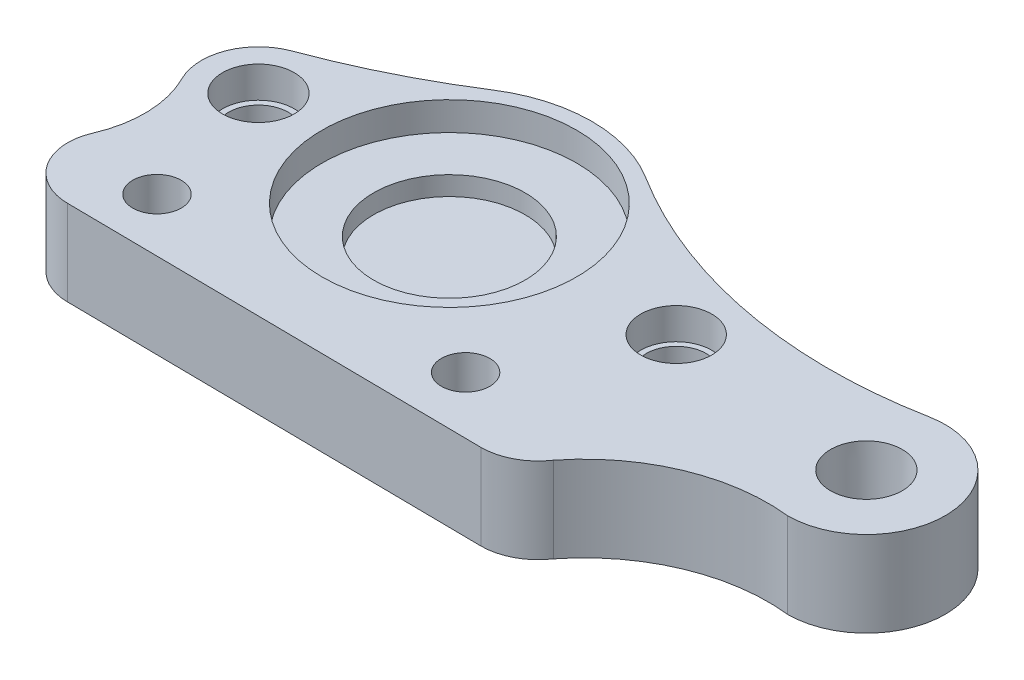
ISO-10303-21;
HEADER;
FILE_DESCRIPTION(('STEP AP214'),'2;1');
FILE_NAME('part.step','',(''),(''),'','','');
FILE_SCHEMA(('AUTOMOTIVE_DESIGN { 1 0 10303 214 1 1 1 1 }'));
ENDSEC;
DATA;
#1=APPLICATION_CONTEXT('core data for automotive mechanical design processes');
#2=APPLICATION_PROTOCOL_DEFINITION('international standard','automotive_design',2000,#1);
#3=PRODUCT_CONTEXT('',#1,'mechanical');
#4=PRODUCT('Part','Part','',(#3));
#5=PRODUCT_RELATED_PRODUCT_CATEGORY('part','',(#4));
#6=PRODUCT_DEFINITION_FORMATION('','',#4);
#7=PRODUCT_DEFINITION_CONTEXT('part definition',#1,'design');
#8=PRODUCT_DEFINITION('design','',#6,#7);
#9=PRODUCT_DEFINITION_SHAPE('','',#8);
#10=(LENGTH_UNIT() NAMED_UNIT(*) SI_UNIT(.MILLI.,.METRE.));
#11=(NAMED_UNIT(*) PLANE_ANGLE_UNIT() SI_UNIT($,.RADIAN.));
#12=(NAMED_UNIT(*) SI_UNIT($,.STERADIAN.) SOLID_ANGLE_UNIT());
#13=UNCERTAINTY_MEASURE_WITH_UNIT(LENGTH_MEASURE(1.E-05),#10,'distance_accuracy_value','');
#14=(GEOMETRIC_REPRESENTATION_CONTEXT(3) GLOBAL_UNCERTAINTY_ASSIGNED_CONTEXT((#13)) GLOBAL_UNIT_ASSIGNED_CONTEXT((#10,
#11,#12)) REPRESENTATION_CONTEXT('',''));
#15=CARTESIAN_POINT('',(0.,0.,0.));
#16=DIRECTION('',(0.,0.,1.));
#17=DIRECTION('',(1.,0.,0.));
#18=AXIS2_PLACEMENT_3D('',#15,#16,#17);
#19=CARTESIAN_POINT('',(-40.22,18.,0.));
#20=DIRECTION('',(0.,-1.,0.));
#21=DIRECTION('',(0.,0.,-1.));
#22=AXIS2_PLACEMENT_3D('',#19,#20,#21);
#23=CYLINDRICAL_SURFACE('',#22,12.);
#24=CARTESIAN_POINT('',(-40.22,0.,0.));
#25=DIRECTION('',(0.,1.,0.));
#26=DIRECTION('',(0.,0.,1.));
#27=AXIS2_PLACEMENT_3D('',#24,#25,#26);
#28=CIRCLE('',#27,12.);
#29=CARTESIAN_POINT('',(-44.3920821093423,0.,-11.2513879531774));
#30=VERTEX_POINT('',#29);
#31=CARTESIAN_POINT('',(-50.9462208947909,0.,5.38035178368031));
#32=VERTEX_POINT('',#31);
#33=EDGE_CURVE('E233',#30,#32,#28,.T.);
#34=ORIENTED_EDGE('',*,*,#33,.T.);
#35=DIRECTION('',(0.,-1.,0.));
#36=VECTOR('',#35,1.);
#37=CARTESIAN_POINT('',(-50.9462208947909,18.,5.38035178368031));
#38=LINE('',#37,#36);
#39=CARTESIAN_POINT('',(-50.9462208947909,18.,5.38035178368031));
#40=VERTEX_POINT('',#39);
#41=EDGE_CURVE('E185',#40,#32,#38,.T.);
#42=ORIENTED_EDGE('',*,*,#41,.F.);
#43=CARTESIAN_POINT('',(-40.22,18.,0.));
#44=DIRECTION('',(0.,1.,0.));
#45=DIRECTION('',(0.,0.,1.));
#46=AXIS2_PLACEMENT_3D('',#43,#44,#45);
#47=CIRCLE('',#46,12.);
#48=CARTESIAN_POINT('',(-44.3920821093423,18.,-11.2513879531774));
#49=VERTEX_POINT('',#48);
#50=EDGE_CURVE('E281',#49,#40,#47,.T.);
#51=ORIENTED_EDGE('',*,*,#50,.F.);
#52=DIRECTION('',(0.,-1.,0.));
#53=VECTOR('',#52,1.);
#54=CARTESIAN_POINT('',(-44.3920821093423,18.,-11.2513879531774));
#55=LINE('',#54,#53);
#56=EDGE_CURVE('E192',#49,#30,#55,.T.);
#57=ORIENTED_EDGE('',*,*,#56,.T.);
#58=EDGE_LOOP('',(#34,#42,#51,#57));
#59=FACE_BOUND('',#58,.T.);
#60=ADVANCED_FACE('F73',(#59),#23,.T.);
#61=CARTESIAN_POINT('',(-71.3762101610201,18.,15.628185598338));
#62=DIRECTION('',(0.,-1.,0.));
#63=DIRECTION('',(0.,0.,-1.));
#64=AXIS2_PLACEMENT_3D('',#61,#62,#63);
#65=CYLINDRICAL_SURFACE('',#64,22.8561273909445);
#66=CARTESIAN_POINT('',(-71.3762101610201,0.,15.628185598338));
#67=DIRECTION('',(0.,1.,0.));
#68=DIRECTION('',(0.,0.,1.));
#69=AXIS2_PLACEMENT_3D('',#66,#67,#68);
#70=CIRCLE('',#69,22.8561273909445);
#71=CARTESIAN_POINT('',(-50.3923689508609,0.,24.688040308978));
#72=VERTEX_POINT('',#71);
#73=EDGE_CURVE('E237',#32,#72,#70,.F.);
#74=ORIENTED_EDGE('',*,*,#73,.T.);
#75=DIRECTION('',(0.,-1.,0.));
#76=VECTOR('',#75,1.);
#77=CARTESIAN_POINT('',(-50.3923689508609,18.,24.688040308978));
#78=LINE('',#77,#76);
#79=CARTESIAN_POINT('',(-50.3923689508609,18.,24.688040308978));
#80=VERTEX_POINT('',#79);
#81=EDGE_CURVE('E181',#80,#72,#78,.T.);
#82=ORIENTED_EDGE('',*,*,#81,.F.);
#83=CARTESIAN_POINT('',(-71.3762101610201,18.,15.628185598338));
#84=DIRECTION('',(0.,1.,0.));
#85=DIRECTION('',(0.,0.,1.));
#86=AXIS2_PLACEMENT_3D('',#83,#84,#85);
#87=CIRCLE('',#86,22.8561273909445);
#88=EDGE_CURVE('E172',#40,#80,#87,.F.);
#89=ORIENTED_EDGE('',*,*,#88,.F.);
#90=ORIENTED_EDGE('',*,*,#41,.T.);
#91=EDGE_LOOP('',(#74,#82,#89,#90));
#92=FACE_BOUND('',#91,.T.);
#93=ADVANCED_FACE('F290',(#92),#65,.F.);
#94=CARTESIAN_POINT('',(-40.22,18.,29.08));
#95=DIRECTION('',(0.,-1.,0.));
#96=DIRECTION('',(0.,0.,-1.));
#97=AXIS2_PLACEMENT_3D('',#94,#95,#96);
#98=CYLINDRICAL_SURFACE('',#97,11.08);
#99=CARTESIAN_POINT('',(-40.22,0.,29.08));
#100=DIRECTION('',(0.,1.,0.));
#101=DIRECTION('',(0.,0.,1.));
#102=AXIS2_PLACEMENT_3D('',#99,#100,#101);
#103=CIRCLE('',#102,11.08);
#104=CARTESIAN_POINT('',(-40.22,0.,40.16));
#105=VERTEX_POINT('',#104);
#106=EDGE_CURVE('E179',#72,#105,#103,.T.);
#107=ORIENTED_EDGE('',*,*,#106,.T.);
#108=DIRECTION('',(0.,-1.,0.));
#109=VECTOR('',#108,1.);
#110=CARTESIAN_POINT('',(-40.22,18.,40.16));
#111=LINE('',#110,#109);
#112=CARTESIAN_POINT('',(-40.22,18.,40.16));
#113=VERTEX_POINT('',#112);
#114=EDGE_CURVE('E162',#113,#105,#111,.T.);
#115=ORIENTED_EDGE('',*,*,#114,.F.);
#116=CARTESIAN_POINT('',(-40.22,18.,29.08));
#117=DIRECTION('',(0.,1.,0.));
#118=DIRECTION('',(0.,0.,1.));
#119=AXIS2_PLACEMENT_3D('',#116,#117,#118);
#120=CIRCLE('',#119,11.08);
#121=EDGE_CURVE('E166',#80,#113,#120,.T.);
#122=ORIENTED_EDGE('',*,*,#121,.F.);
#123=ORIENTED_EDGE('',*,*,#81,.T.);
#124=EDGE_LOOP('',(#107,#115,#122,#123));
#125=FACE_BOUND('',#124,.T.);
#126=ADVANCED_FACE('F178',(#125),#98,.T.);
#127=CARTESIAN_POINT('',(-0.456832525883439,18.,40.6073356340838));
#128=DIRECTION('',(0.0112492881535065,0.,-0.999936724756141));
#129=DIRECTION('',(-0.999936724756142,0.,-0.0112492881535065));
#130=AXIS2_PLACEMENT_3D('',#127,#128,#129);
#131=PLANE('',#130);
#132=DIRECTION('',(0.999936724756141,0.,0.0112492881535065));
#133=VECTOR('',#132,1.);
#134=CARTESIAN_POINT('',(-0.456832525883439,0.,40.6073356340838));
#135=LINE('',#134,#133);
#136=CARTESIAN_POINT('',(47.78,0.,41.15));
#137=VERTEX_POINT('',#136);
#138=EDGE_CURVE('E243',#105,#137,#135,.T.);
#139=ORIENTED_EDGE('',*,*,#138,.T.);
#140=DIRECTION('',(0.,-1.,0.));
#141=VECTOR('',#140,1.);
#142=CARTESIAN_POINT('',(47.78,18.,41.15));
#143=LINE('',#142,#141);
#144=CARTESIAN_POINT('',(47.78,18.,41.15));
#145=VERTEX_POINT('',#144);
#146=EDGE_CURVE('E164',#145,#137,#143,.T.);
#147=ORIENTED_EDGE('',*,*,#146,.F.);
#148=DIRECTION('',(0.999936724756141,0.,0.0112492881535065));
#149=VECTOR('',#148,1.);
#150=CARTESIAN_POINT('',(-0.456832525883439,18.,40.6073356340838));
#151=LINE('',#150,#149);
#152=EDGE_CURVE('E157',#113,#145,#151,.T.);
#153=ORIENTED_EDGE('',*,*,#152,.F.);
#154=ORIENTED_EDGE('',*,*,#114,.T.);
#155=EDGE_LOOP('',(#139,#147,#153,#154));
#156=FACE_BOUND('',#155,.T.);
#157=ADVANCED_FACE('F160',(#156),#131,.F.);
#158=CARTESIAN_POINT('',(47.78,18.,29.08));
#159=DIRECTION('',(0.,-1.,0.));
#160=DIRECTION('',(0.,0.,-1.));
#161=AXIS2_PLACEMENT_3D('',#158,#159,#160);
#162=CYLINDRICAL_SURFACE('',#161,12.07);
#163=CARTESIAN_POINT('',(47.78,0.,29.08));
#164=DIRECTION('',(0.,1.,0.));
#165=DIRECTION('',(0.,0.,1.));
#166=AXIS2_PLACEMENT_3D('',#163,#164,#165);
#167=CIRCLE('',#166,12.07);
#168=CARTESIAN_POINT('',(57.7774061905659,0.,35.8428965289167));
#169=VERTEX_POINT('',#168);
#170=EDGE_CURVE('E124',#137,#169,#167,.T.);
#171=ORIENTED_EDGE('',*,*,#170,.T.);
#172=DIRECTION('',(0.,-1.,0.));
#173=VECTOR('',#172,1.);
#174=CARTESIAN_POINT('',(57.7774061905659,18.,35.8428965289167));
#175=LINE('',#174,#173);
#176=CARTESIAN_POINT('',(57.7774061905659,18.,35.8428965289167));
#177=VERTEX_POINT('',#176);
#178=EDGE_CURVE('E131',#177,#169,#175,.T.);
#179=ORIENTED_EDGE('',*,*,#178,.F.);
#180=CARTESIAN_POINT('',(47.78,18.,29.08));
#181=DIRECTION('',(0.,1.,0.));
#182=DIRECTION('',(0.,0.,1.));
#183=AXIS2_PLACEMENT_3D('',#180,#181,#182);
#184=CIRCLE('',#183,12.07);
#185=EDGE_CURVE('E91',#145,#177,#184,.T.);
#186=ORIENTED_EDGE('',*,*,#185,.F.);
#187=ORIENTED_EDGE('',*,*,#146,.T.);
#188=EDGE_LOOP('',(#171,#179,#186,#187));
#189=FACE_BOUND('',#188,.T.);
#190=ADVANCED_FACE('F299',(#189),#162,.T.);
#191=CARTESIAN_POINT('',(88.1701871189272,18.,59.7473100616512));
#192=DIRECTION('',(0.,-1.,0.));
#193=DIRECTION('',(0.,0.,-1.));
#194=AXIS2_PLACEMENT_3D('',#191,#192,#193);
#195=CYLINDRICAL_SURFACE('',#194,38.6670676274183);
#196=CARTESIAN_POINT('',(88.1701871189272,0.,59.7473100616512));
#197=DIRECTION('',(0.,1.,0.));
#198=DIRECTION('',(0.,0.,1.));
#199=AXIS2_PLACEMENT_3D('',#196,#197,#198);
#200=CIRCLE('',#199,38.6670676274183);
#201=CARTESIAN_POINT('',(92.5334852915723,0.,21.3272144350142));
#202=VERTEX_POINT('',#201);
#203=EDGE_CURVE('E216',#202,#169,#200,.T.);
#204=ORIENTED_EDGE('',*,*,#203,.F.);
#205=DIRECTION('',(0.,-1.,0.));
#206=VECTOR('',#205,1.);
#207=CARTESIAN_POINT('',(92.5334852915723,18.,21.3272144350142));
#208=LINE('',#207,#206);
#209=CARTESIAN_POINT('',(92.5334852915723,18.,21.3272144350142));
#210=VERTEX_POINT('',#209);
#211=EDGE_CURVE('E12',#210,#202,#208,.T.);
#212=ORIENTED_EDGE('',*,*,#211,.F.);
#213=CARTESIAN_POINT('',(88.1701871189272,18.,59.7473100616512));
#214=DIRECTION('',(0.,1.,0.));
#215=DIRECTION('',(0.,0.,1.));
#216=AXIS2_PLACEMENT_3D('',#213,#214,#215);
#217=CIRCLE('',#216,38.6670676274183);
#218=EDGE_CURVE('E247',#210,#177,#217,.T.);
#219=ORIENTED_EDGE('',*,*,#218,.T.);
#220=ORIENTED_EDGE('',*,*,#178,.T.);
#221=EDGE_LOOP('',(#204,#212,#219,#220));
#222=FACE_BOUND('',#221,.T.);
#223=ADVANCED_FACE('F75',(#222),#195,.F.);
#224=CARTESIAN_POINT('',(92.5334852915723,18.,4.70378084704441));
#225=DIRECTION('',(0.,-1.,0.));
#226=DIRECTION('',(0.,0.,-1.));
#227=AXIS2_PLACEMENT_3D('',#224,#225,#226);
#228=CYLINDRICAL_SURFACE('',#227,16.6234335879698);
#229=CARTESIAN_POINT('',(92.5334852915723,0.,4.70378084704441));
#230=DIRECTION('',(0.,1.,0.));
#231=DIRECTION('',(0.,0.,1.));
#232=AXIS2_PLACEMENT_3D('',#229,#230,#231);
#233=CIRCLE('',#232,16.6234335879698);
#234=CARTESIAN_POINT('',(89.4042227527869,0.,-11.622463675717));
#235=VERTEX_POINT('',#234);
#236=EDGE_CURVE('E213',#202,#235,#233,.T.);
#237=ORIENTED_EDGE('',*,*,#236,.T.);
#238=DIRECTION('',(0.,-1.,0.));
#239=VECTOR('',#238,1.);
#240=CARTESIAN_POINT('',(89.4042227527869,18.,-11.622463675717));
#241=LINE('',#240,#239);
#242=CARTESIAN_POINT('',(89.4042227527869,18.,-11.622463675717));
#243=VERTEX_POINT('',#242);
#244=EDGE_CURVE('E83',#243,#235,#241,.T.);
#245=ORIENTED_EDGE('',*,*,#244,.F.);
#246=CARTESIAN_POINT('',(92.5334852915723,18.,4.70378084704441));
#247=DIRECTION('',(0.,1.,0.));
#248=DIRECTION('',(0.,0.,1.));
#249=AXIS2_PLACEMENT_3D('',#246,#247,#248);
#250=CIRCLE('',#249,16.6234335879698);
#251=EDGE_CURVE('E269',#210,#243,#250,.T.);
#252=ORIENTED_EDGE('',*,*,#251,.F.);
#253=ORIENTED_EDGE('',*,*,#211,.T.);
#254=EDGE_LOOP('',(#237,#245,#252,#253));
#255=FACE_BOUND('',#254,.T.);
#256=ADVANCED_FACE('F214',(#255),#228,.T.);
#257=CARTESIAN_POINT('',(70.1940017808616,18.,-111.847600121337));
#258=DIRECTION('',(0.,-1.,0.));
#259=DIRECTION('',(0.,0.,-1.));
#260=AXIS2_PLACEMENT_3D('',#257,#258,#259);
#261=CYLINDRICAL_SURFACE('',#260,102.049549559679);
#262=CARTESIAN_POINT('',(70.1940017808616,0.,-111.847600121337));
#263=DIRECTION('',(0.,1.,0.));
#264=DIRECTION('',(0.,0.,1.));
#265=AXIS2_PLACEMENT_3D('',#262,#263,#264);
#266=CIRCLE('',#265,102.049549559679);
#267=CARTESIAN_POINT('',(15.9471960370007,0.,-25.4103706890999));
#268=VERTEX_POINT('',#267);
#269=EDGE_CURVE('E208',#268,#235,#266,.T.);
#270=ORIENTED_EDGE('',*,*,#269,.F.);
#271=DIRECTION('',(0.,-1.,0.));
#272=VECTOR('',#271,1.);
#273=CARTESIAN_POINT('',(15.9471960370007,18.,-25.4103706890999));
#274=LINE('',#273,#272);
#275=CARTESIAN_POINT('',(15.9471960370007,18.,-25.4103706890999));
#276=VERTEX_POINT('',#275);
#277=EDGE_CURVE('E198',#276,#268,#274,.T.);
#278=ORIENTED_EDGE('',*,*,#277,.F.);
#279=CARTESIAN_POINT('',(70.1940017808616,18.,-111.847600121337));
#280=DIRECTION('',(0.,1.,0.));
#281=DIRECTION('',(0.,0.,1.));
#282=AXIS2_PLACEMENT_3D('',#279,#280,#281);
#283=CIRCLE('',#282,102.049549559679);
#284=EDGE_CURVE('E210',#276,#243,#283,.T.);
#285=ORIENTED_EDGE('',*,*,#284,.T.);
#286=ORIENTED_EDGE('',*,*,#244,.T.);
#287=EDGE_LOOP('',(#270,#278,#285,#286));
#288=FACE_BOUND('',#287,.T.);
#289=ADVANCED_FACE('F206',(#288),#261,.F.);
#290=CARTESIAN_POINT('',(0.,18.,0.));
#291=DIRECTION('',(0.,-1.,0.));
#292=DIRECTION('',(0.,0.,-1.));
#293=AXIS2_PLACEMENT_3D('',#290,#291,#292);
#294=CYLINDRICAL_SURFACE('',#293,30.);
#295=CARTESIAN_POINT('',(0.,0.,0.));
#296=DIRECTION('',(0.,1.,0.));
#297=DIRECTION('',(0.,0.,1.));
#298=AXIS2_PLACEMENT_3D('',#295,#296,#297);
#299=CIRCLE('',#298,30.);
#300=CARTESIAN_POINT('',(-16.1209036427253,0.,-25.3005230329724));
#301=VERTEX_POINT('',#300);
#302=EDGE_CURVE('E223',#268,#301,#299,.T.);
#303=ORIENTED_EDGE('',*,*,#302,.T.);
#304=DIRECTION('',(0.,-1.,0.));
#305=VECTOR('',#304,1.);
#306=CARTESIAN_POINT('',(-16.1209036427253,18.,-25.3005230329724));
#307=LINE('',#306,#305);
#308=CARTESIAN_POINT('',(-16.1209036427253,18.,-25.3005230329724));
#309=VERTEX_POINT('',#308);
#310=EDGE_CURVE('E195',#309,#301,#307,.T.);
#311=ORIENTED_EDGE('',*,*,#310,.F.);
#312=CARTESIAN_POINT('',(0.,18.,0.));
#313=DIRECTION('',(0.,1.,0.));
#314=DIRECTION('',(0.,0.,1.));
#315=AXIS2_PLACEMENT_3D('',#312,#313,#314);
#316=CIRCLE('',#315,30.);
#317=EDGE_CURVE('E274',#276,#309,#316,.T.);
#318=ORIENTED_EDGE('',*,*,#317,.F.);
#319=ORIENTED_EDGE('',*,*,#277,.T.);
#320=EDGE_LOOP('',(#303,#311,#318,#319));
#321=FACE_BOUND('',#320,.T.);
#322=ADVANCED_FACE('F297',(#321),#294,.T.);
#323=CARTESIAN_POINT('',(-96.2089551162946,18.,-150.992583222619));
#324=DIRECTION('',(0.,-1.,0.));
#325=DIRECTION('',(0.,0.,-1.));
#326=AXIS2_PLACEMENT_3D('',#323,#324,#325);
#327=CYLINDRICAL_SURFACE('',#326,149.038887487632);
#328=CARTESIAN_POINT('',(-96.2089551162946,0.,-150.992583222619));
#329=DIRECTION('',(0.,1.,0.));
#330=DIRECTION('',(0.,0.,1.));
#331=AXIS2_PLACEMENT_3D('',#328,#329,#330);
#332=CIRCLE('',#331,149.038887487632);
#333=EDGE_CURVE('E227',#30,#301,#332,.T.);
#334=ORIENTED_EDGE('',*,*,#333,.F.);
#335=ORIENTED_EDGE('',*,*,#56,.F.);
#336=CARTESIAN_POINT('',(-96.2089551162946,18.,-150.992583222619));
#337=DIRECTION('',(0.,1.,0.));
#338=DIRECTION('',(0.,0.,1.));
#339=AXIS2_PLACEMENT_3D('',#336,#337,#338);
#340=CIRCLE('',#339,149.038887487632);
#341=EDGE_CURVE('E277',#49,#309,#340,.T.);
#342=ORIENTED_EDGE('',*,*,#341,.T.);
#343=ORIENTED_EDGE('',*,*,#310,.T.);
#344=EDGE_LOOP('',(#334,#335,#342,#343));
#345=FACE_BOUND('',#344,.T.);
#346=ADVANCED_FACE('F293',(#345),#327,.F.);
#347=CARTESIAN_POINT('',(0.,0.,0.));
#348=DIRECTION('',(0.,1.,0.));
#349=DIRECTION('',(0.,0.,1.));
#350=AXIS2_PLACEMENT_3D('',#347,#348,#349);
#351=PLANE('',#350);
#352=CARTESIAN_POINT('',(-32.5,0.,29.08));
#353=DIRECTION('',(0.,1.,0.));
#354=DIRECTION('',(0.,0.,1.));
#355=AXIS2_PLACEMENT_3D('',#352,#353,#354);
#356=CIRCLE('',#355,5.1);
#357=CARTESIAN_POINT('',(-32.5,0.,34.18));
#358=VERTEX_POINT('',#357);
#359=EDGE_CURVE('E574',#358,#358,#356,.T.);
#360=ORIENTED_EDGE('',*,*,#359,.T.);
#361=EDGE_LOOP('',(#360));
#362=FACE_BOUND('',#361,.T.);
#363=CARTESIAN_POINT('',(32.5,0.,29.08));
#364=DIRECTION('',(0.,1.,0.));
#365=DIRECTION('',(0.,0.,1.));
#366=AXIS2_PLACEMENT_3D('',#363,#364,#365);
#367=CIRCLE('',#366,5.10000000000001);
#368=CARTESIAN_POINT('',(32.5,0.,34.18));
#369=VERTEX_POINT('',#368);
#370=EDGE_CURVE('E579',#369,#369,#367,.T.);
#371=ORIENTED_EDGE('',*,*,#370,.T.);
#372=EDGE_LOOP('',(#371));
#373=FACE_BOUND('',#372,.T.);
#374=CARTESIAN_POINT('',(92.5334852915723,0.,4.70378084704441));
#375=DIRECTION('',(0.,1.,0.));
#376=DIRECTION('',(0.,0.,1.));
#377=AXIS2_PLACEMENT_3D('',#374,#375,#376);
#378=CIRCLE('',#377,6.78928216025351);
#379=CARTESIAN_POINT('',(92.5334852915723,0.,11.4930630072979));
#380=VERTEX_POINT('',#379);
#381=EDGE_CURVE('E595',#380,#380,#378,.T.);
#382=ORIENTED_EDGE('',*,*,#381,.T.);
#383=EDGE_LOOP('',(#382));
#384=FACE_BOUND('',#383,.T.);
#385=CARTESIAN_POINT('',(-40.22,0.,0.));
#386=DIRECTION('',(0.,1.,0.));
#387=DIRECTION('',(0.,0.,1.));
#388=AXIS2_PLACEMENT_3D('',#385,#386,#387);
#389=CIRCLE('',#388,6.3);
#390=CARTESIAN_POINT('',(-40.22,0.,6.3));
#391=VERTEX_POINT('',#390);
#392=EDGE_CURVE('E600',#391,#391,#389,.T.);
#393=ORIENTED_EDGE('',*,*,#392,.T.);
#394=EDGE_LOOP('',(#393));
#395=FACE_BOUND('',#394,.T.);
#396=CARTESIAN_POINT('',(47.78,0.,0.));
#397=DIRECTION('',(0.,1.,0.));
#398=DIRECTION('',(0.,0.,1.));
#399=AXIS2_PLACEMENT_3D('',#396,#397,#398);
#400=CIRCLE('',#399,6.3);
#401=CARTESIAN_POINT('',(47.78,0.,6.3));
#402=VERTEX_POINT('',#401);
#403=EDGE_CURVE('E609',#402,#402,#400,.T.);
#404=ORIENTED_EDGE('',*,*,#403,.T.);
#405=EDGE_LOOP('',(#404));
#406=FACE_BOUND('',#405,.T.);
#407=ORIENTED_EDGE('',*,*,#73,.F.);
#408=ORIENTED_EDGE('',*,*,#33,.F.);
#409=ORIENTED_EDGE('',*,*,#333,.T.);
#410=ORIENTED_EDGE('',*,*,#302,.F.);
#411=ORIENTED_EDGE('',*,*,#269,.T.);
#412=ORIENTED_EDGE('',*,*,#236,.F.);
#413=ORIENTED_EDGE('',*,*,#203,.T.);
#414=ORIENTED_EDGE('',*,*,#170,.F.);
#415=ORIENTED_EDGE('',*,*,#138,.F.);
#416=ORIENTED_EDGE('',*,*,#106,.F.);
#417=EDGE_LOOP('',(#407,#408,#409,#410,#411,#412,#413,#414,#415,#416));
#418=FACE_BOUND('',#417,.T.);
#419=ADVANCED_FACE('F220',(#362,#373,#384,#395,#406,#418),#351,.F.);
#420=CARTESIAN_POINT('',(0.,18.,0.));
#421=DIRECTION('',(0.,1.,0.));
#422=DIRECTION('',(0.,0.,1.));
#423=AXIS2_PLACEMENT_3D('',#420,#421,#422);
#424=PLANE('',#423);
#425=CARTESIAN_POINT('',(-32.5,18.,29.08));
#426=DIRECTION('',(0.,1.,0.));
#427=DIRECTION('',(0.,0.,1.));
#428=AXIS2_PLACEMENT_3D('',#425,#426,#427);
#429=CIRCLE('',#428,5.1);
#430=CARTESIAN_POINT('',(-32.5,18.,34.18));
#431=VERTEX_POINT('',#430);
#432=EDGE_CURVE('E577',#431,#431,#429,.T.);
#433=ORIENTED_EDGE('',*,*,#432,.F.);
#434=EDGE_LOOP('',(#433));
#435=FACE_BOUND('',#434,.T.);
#436=CARTESIAN_POINT('',(32.5,18.,29.08));
#437=DIRECTION('',(0.,1.,0.));
#438=DIRECTION('',(0.,0.,1.));
#439=AXIS2_PLACEMENT_3D('',#436,#437,#438);
#440=CIRCLE('',#439,5.10000000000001);
#441=CARTESIAN_POINT('',(32.5,18.,34.18));
#442=VERTEX_POINT('',#441);
#443=EDGE_CURVE('E586',#442,#442,#440,.T.);
#444=ORIENTED_EDGE('',*,*,#443,.F.);
#445=EDGE_LOOP('',(#444));
#446=FACE_BOUND('',#445,.T.);
#447=CARTESIAN_POINT('',(92.5334852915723,18.,4.70378084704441));
#448=DIRECTION('',(0.,1.,0.));
#449=DIRECTION('',(0.,0.,1.));
#450=AXIS2_PLACEMENT_3D('',#447,#448,#449);
#451=CIRCLE('',#450,7.55);
#452=CARTESIAN_POINT('',(92.5334852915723,18.,12.2537808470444));
#453=VERTEX_POINT('',#452);
#454=EDGE_CURVE('E583',#453,#453,#451,.T.);
#455=ORIENTED_EDGE('',*,*,#454,.F.);
#456=EDGE_LOOP('',(#455));
#457=FACE_BOUND('',#456,.T.);
#458=CARTESIAN_POINT('',(-40.22,18.,0.));
#459=DIRECTION('',(0.,1.,0.));
#460=DIRECTION('',(0.,0.,1.));
#461=AXIS2_PLACEMENT_3D('',#458,#459,#460);
#462=CIRCLE('',#461,7.55);
#463=CARTESIAN_POINT('',(-40.22,18.,7.55000000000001));
#464=VERTEX_POINT('',#463);
#465=EDGE_CURVE('E620',#464,#464,#462,.T.);
#466=ORIENTED_EDGE('',*,*,#465,.F.);
#467=EDGE_LOOP('',(#466));
#468=FACE_BOUND('',#467,.T.);
#469=CARTESIAN_POINT('',(47.78,18.,0.));
#470=DIRECTION('',(0.,1.,0.));
#471=DIRECTION('',(0.,0.,1.));
#472=AXIS2_PLACEMENT_3D('',#469,#470,#471);
#473=CIRCLE('',#472,7.48185713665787);
#474=CARTESIAN_POINT('',(47.78,18.,7.48185713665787));
#475=VERTEX_POINT('',#474);
#476=EDGE_CURVE('E604',#475,#475,#473,.T.);
#477=ORIENTED_EDGE('',*,*,#476,.F.);
#478=EDGE_LOOP('',(#477));
#479=FACE_BOUND('',#478,.T.);
#480=CARTESIAN_POINT('',(0.,18.,0.));
#481=DIRECTION('',(0.,1.,0.));
#482=DIRECTION('',(0.,0.,1.));
#483=AXIS2_PLACEMENT_3D('',#480,#481,#482);
#484=CIRCLE('',#483,26.8);
#485=CARTESIAN_POINT('',(0.,18.,26.8));
#486=VERTEX_POINT('',#485);
#487=EDGE_CURVE('E255',#486,#486,#484,.T.);
#488=ORIENTED_EDGE('',*,*,#487,.F.);
#489=EDGE_LOOP('',(#488));
#490=FACE_BOUND('',#489,.T.);
#491=ORIENTED_EDGE('',*,*,#50,.T.);
#492=ORIENTED_EDGE('',*,*,#88,.T.);
#493=ORIENTED_EDGE('',*,*,#121,.T.);
#494=ORIENTED_EDGE('',*,*,#152,.T.);
#495=ORIENTED_EDGE('',*,*,#185,.T.);
#496=ORIENTED_EDGE('',*,*,#218,.F.);
#497=ORIENTED_EDGE('',*,*,#251,.T.);
#498=ORIENTED_EDGE('',*,*,#284,.F.);
#499=ORIENTED_EDGE('',*,*,#317,.T.);
#500=ORIENTED_EDGE('',*,*,#341,.F.);
#501=EDGE_LOOP('',(#491,#492,#493,#494,#495,#496,#497,#498,#499,#500));
#502=FACE_BOUND('',#501,.T.);
#503=ADVANCED_FACE('F170',(#435,#446,#457,#468,#479,#490,#502),#424,.T.);
#504=CARTESIAN_POINT('',(0.,12.,0.));
#505=DIRECTION('',(0.,1.,0.));
#506=DIRECTION('',(0.,0.,1.));
#507=AXIS2_PLACEMENT_3D('',#504,#505,#506);
#508=CYLINDRICAL_SURFACE('',#507,26.8);
#509=CARTESIAN_POINT('',(0.,12.,0.));
#510=DIRECTION('',(0.,1.,0.));
#511=DIRECTION('',(0.,0.,1.));
#512=AXIS2_PLACEMENT_3D('',#509,#510,#511);
#513=CIRCLE('',#512,26.8);
#514=CARTESIAN_POINT('',(0.,12.,26.8));
#515=VERTEX_POINT('',#514);
#516=EDGE_CURVE('E252',#515,#515,#513,.T.);
#517=ORIENTED_EDGE('',*,*,#516,.F.);
#518=EDGE_LOOP('',(#517));
#519=FACE_BOUND('',#518,.T.);
#520=ORIENTED_EDGE('',*,*,#487,.T.);
#521=EDGE_LOOP('',(#520));
#522=FACE_BOUND('',#521,.T.);
#523=ADVANCED_FACE('F314',(#519,#522),#508,.F.);
#524=CARTESIAN_POINT('',(0.,12.,0.));
#525=DIRECTION('',(0.,1.,0.));
#526=DIRECTION('',(0.,0.,1.));
#527=AXIS2_PLACEMENT_3D('',#524,#525,#526);
#528=PLANE('',#527);
#529=CARTESIAN_POINT('',(0.,12.,0.));
#530=DIRECTION('',(0.,1.,0.));
#531=DIRECTION('',(0.,0.,1.));
#532=AXIS2_PLACEMENT_3D('',#529,#530,#531);
#533=CIRCLE('',#532,15.95);
#534=CARTESIAN_POINT('',(0.,12.,15.95));
#535=VERTEX_POINT('',#534);
#536=EDGE_CURVE('E264',#535,#535,#533,.T.);
#537=ORIENTED_EDGE('',*,*,#536,.F.);
#538=EDGE_LOOP('',(#537));
#539=FACE_BOUND('',#538,.T.);
#540=ORIENTED_EDGE('',*,*,#516,.T.);
#541=EDGE_LOOP('',(#540));
#542=FACE_BOUND('',#541,.T.);
#543=ADVANCED_FACE('F356',(#539,#542),#528,.T.);
#544=CARTESIAN_POINT('',(0.,8.,0.));
#545=DIRECTION('',(0.,1.,0.));
#546=DIRECTION('',(0.,0.,1.));
#547=AXIS2_PLACEMENT_3D('',#544,#545,#546);
#548=CYLINDRICAL_SURFACE('',#547,15.95);
#549=CARTESIAN_POINT('',(0.,8.,0.));
#550=DIRECTION('',(0.,1.,0.));
#551=DIRECTION('',(0.,0.,1.));
#552=AXIS2_PLACEMENT_3D('',#549,#550,#551);
#553=CIRCLE('',#552,15.95);
#554=CARTESIAN_POINT('',(0.,8.,15.95));
#555=VERTEX_POINT('',#554);
#556=EDGE_CURVE('E261',#555,#555,#553,.T.);
#557=ORIENTED_EDGE('',*,*,#556,.F.);
#558=EDGE_LOOP('',(#557));
#559=FACE_BOUND('',#558,.T.);
#560=ORIENTED_EDGE('',*,*,#536,.T.);
#561=EDGE_LOOP('',(#560));
#562=FACE_BOUND('',#561,.T.);
#563=ADVANCED_FACE('F364',(#559,#562),#548,.F.);
#564=CARTESIAN_POINT('',(0.,8.,0.));
#565=DIRECTION('',(0.,1.,0.));
#566=DIRECTION('',(0.,0.,1.));
#567=AXIS2_PLACEMENT_3D('',#564,#565,#566);
#568=PLANE('',#567);
#569=ORIENTED_EDGE('',*,*,#556,.T.);
#570=EDGE_LOOP('',(#569));
#571=FACE_BOUND('',#570,.T.);
#572=ADVANCED_FACE('F372',(#571),#568,.T.);
#573=CARTESIAN_POINT('',(47.78,11.4,0.));
#574=DIRECTION('',(0.,1.,0.));
#575=DIRECTION('',(0.,0.,1.));
#576=AXIS2_PLACEMENT_3D('',#573,#574,#575);
#577=CYLINDRICAL_SURFACE('',#576,7.48185713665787);
#578=CARTESIAN_POINT('',(47.78,11.4,0.));
#579=DIRECTION('',(0.,1.,0.));
#580=DIRECTION('',(0.,0.,1.));
#581=AXIS2_PLACEMENT_3D('',#578,#579,#580);
#582=CIRCLE('',#581,7.48185713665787);
#583=CARTESIAN_POINT('',(47.78,11.4,7.48185713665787));
#584=VERTEX_POINT('',#583);
#585=EDGE_CURVE('E624',#584,#584,#582,.T.);
#586=ORIENTED_EDGE('',*,*,#585,.F.);
#587=EDGE_LOOP('',(#586));
#588=FACE_BOUND('',#587,.T.);
#589=ORIENTED_EDGE('',*,*,#476,.T.);
#590=EDGE_LOOP('',(#589));
#591=FACE_BOUND('',#590,.T.);
#592=ADVANCED_FACE('F380',(#588,#591),#577,.F.);
#593=CARTESIAN_POINT('',(47.78,11.4,0.));
#594=DIRECTION('',(0.,1.,0.));
#595=DIRECTION('',(0.,0.,1.));
#596=AXIS2_PLACEMENT_3D('',#593,#594,#595);
#597=PLANE('',#596);
#598=CARTESIAN_POINT('',(47.78,11.4,0.));
#599=DIRECTION('',(0.,1.,0.));
#600=DIRECTION('',(0.,0.,1.));
#601=AXIS2_PLACEMENT_3D('',#598,#599,#600);
#602=CIRCLE('',#601,6.3);
#603=CARTESIAN_POINT('',(47.78,11.4,6.3));
#604=VERTEX_POINT('',#603);
#605=EDGE_CURVE('E599',#604,#604,#602,.T.);
#606=ORIENTED_EDGE('',*,*,#605,.F.);
#607=EDGE_LOOP('',(#606));
#608=FACE_BOUND('',#607,.T.);
#609=ORIENTED_EDGE('',*,*,#585,.T.);
#610=EDGE_LOOP('',(#609));
#611=FACE_BOUND('',#610,.T.);
#612=ADVANCED_FACE('F388',(#608,#611),#597,.T.);
#613=CARTESIAN_POINT('',(-40.22,11.4,0.));
#614=DIRECTION('',(0.,1.,0.));
#615=DIRECTION('',(0.,0.,1.));
#616=AXIS2_PLACEMENT_3D('',#613,#614,#615);
#617=CYLINDRICAL_SURFACE('',#616,7.55);
#618=CARTESIAN_POINT('',(-40.22,11.4,0.));
#619=DIRECTION('',(0.,1.,0.));
#620=DIRECTION('',(0.,0.,1.));
#621=AXIS2_PLACEMENT_3D('',#618,#619,#620);
#622=CIRCLE('',#621,7.55);
#623=CARTESIAN_POINT('',(-40.22,11.4,7.55000000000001));
#624=VERTEX_POINT('',#623);
#625=EDGE_CURVE('E616',#624,#624,#622,.T.);
#626=ORIENTED_EDGE('',*,*,#625,.F.);
#627=EDGE_LOOP('',(#626));
#628=FACE_BOUND('',#627,.T.);
#629=ORIENTED_EDGE('',*,*,#465,.T.);
#630=EDGE_LOOP('',(#629));
#631=FACE_BOUND('',#630,.T.);
#632=ADVANCED_FACE('F397',(#628,#631),#617,.F.);
#633=CARTESIAN_POINT('',(-40.22,11.4,0.));
#634=DIRECTION('',(0.,1.,0.));
#635=DIRECTION('',(0.,0.,1.));
#636=AXIS2_PLACEMENT_3D('',#633,#634,#635);
#637=PLANE('',#636);
#638=CARTESIAN_POINT('',(-40.22,11.4,0.));
#639=DIRECTION('',(0.,1.,0.));
#640=DIRECTION('',(0.,0.,1.));
#641=AXIS2_PLACEMENT_3D('',#638,#639,#640);
#642=CIRCLE('',#641,6.3);
#643=CARTESIAN_POINT('',(-40.22,11.4,6.3));
#644=VERTEX_POINT('',#643);
#645=EDGE_CURVE('E605',#644,#644,#642,.T.);
#646=ORIENTED_EDGE('',*,*,#645,.F.);
#647=EDGE_LOOP('',(#646));
#648=FACE_BOUND('',#647,.T.);
#649=ORIENTED_EDGE('',*,*,#625,.T.);
#650=EDGE_LOOP('',(#649));
#651=FACE_BOUND('',#650,.T.);
#652=ADVANCED_FACE('F405',(#648,#651),#637,.T.);
#653=CARTESIAN_POINT('',(47.78,0.,0.));
#654=DIRECTION('',(0.,1.,0.));
#655=DIRECTION('',(0.,0.,1.));
#656=AXIS2_PLACEMENT_3D('',#653,#654,#655);
#657=CYLINDRICAL_SURFACE('',#656,6.3);
#658=ORIENTED_EDGE('',*,*,#403,.F.);
#659=EDGE_LOOP('',(#658));
#660=FACE_BOUND('',#659,.T.);
#661=ORIENTED_EDGE('',*,*,#605,.T.);
#662=EDGE_LOOP('',(#661));
#663=FACE_BOUND('',#662,.T.);
#664=ADVANCED_FACE('F412',(#660,#663),#657,.F.);
#665=CARTESIAN_POINT('',(-40.22,0.,0.));
#666=DIRECTION('',(0.,1.,0.));
#667=DIRECTION('',(0.,0.,1.));
#668=AXIS2_PLACEMENT_3D('',#665,#666,#667);
#669=CYLINDRICAL_SURFACE('',#668,6.3);
#670=ORIENTED_EDGE('',*,*,#392,.F.);
#671=EDGE_LOOP('',(#670));
#672=FACE_BOUND('',#671,.T.);
#673=ORIENTED_EDGE('',*,*,#645,.T.);
#674=EDGE_LOOP('',(#673));
#675=FACE_BOUND('',#674,.T.);
#676=ADVANCED_FACE('F420',(#672,#675),#669,.F.);
#677=CARTESIAN_POINT('',(92.5334852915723,18.,4.70378084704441));
#678=DIRECTION('',(0.,1.,0.));
#679=DIRECTION('',(0.,0.,1.));
#680=AXIS2_PLACEMENT_3D('',#677,#678,#679);
#681=CONICAL_SURFACE('',#680,7.55,0.0422369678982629);
#682=ORIENTED_EDGE('',*,*,#381,.F.);
#683=EDGE_LOOP('',(#682));
#684=FACE_BOUND('',#683,.T.);
#685=ORIENTED_EDGE('',*,*,#454,.T.);
#686=EDGE_LOOP('',(#685));
#687=FACE_BOUND('',#686,.T.);
#688=ADVANCED_FACE('F428',(#684,#687),#681,.F.);
#689=CARTESIAN_POINT('',(32.5,0.,29.08));
#690=DIRECTION('',(0.,1.,0.));
#691=DIRECTION('',(0.,0.,1.));
#692=AXIS2_PLACEMENT_3D('',#689,#690,#691);
#693=CYLINDRICAL_SURFACE('',#692,5.10000000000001);
#694=ORIENTED_EDGE('',*,*,#370,.F.);
#695=EDGE_LOOP('',(#694));
#696=FACE_BOUND('',#695,.T.);
#697=ORIENTED_EDGE('',*,*,#443,.T.);
#698=EDGE_LOOP('',(#697));
#699=FACE_BOUND('',#698,.T.);
#700=ADVANCED_FACE('F435',(#696,#699),#693,.F.);
#701=CARTESIAN_POINT('',(-32.5,0.,29.08));
#702=DIRECTION('',(0.,1.,0.));
#703=DIRECTION('',(0.,0.,1.));
#704=AXIS2_PLACEMENT_3D('',#701,#702,#703);
#705=CYLINDRICAL_SURFACE('',#704,5.1);
#706=ORIENTED_EDGE('',*,*,#359,.F.);
#707=EDGE_LOOP('',(#706));
#708=FACE_BOUND('',#707,.T.);
#709=ORIENTED_EDGE('',*,*,#432,.T.);
#710=EDGE_LOOP('',(#709));
#711=FACE_BOUND('',#710,.T.);
#712=ADVANCED_FACE('F442',(#708,#711),#705,.F.);
#713=CLOSED_SHELL('',(#60,#93,#126,#157,#190,#223,#256,#289,#322,#346,#419,#503,#523,#543,#563,
#572,#592,#612,#632,#652,#664,#676,#688,#700,#712));
#714=MANIFOLD_SOLID_BREP('B2',#713);
#715=ADVANCED_BREP_SHAPE_REPRESENTATION('',(#18,#714),#14);
#716=SHAPE_DEFINITION_REPRESENTATION(#9,#715);
ENDSEC;
END-ISO-10303-21;
